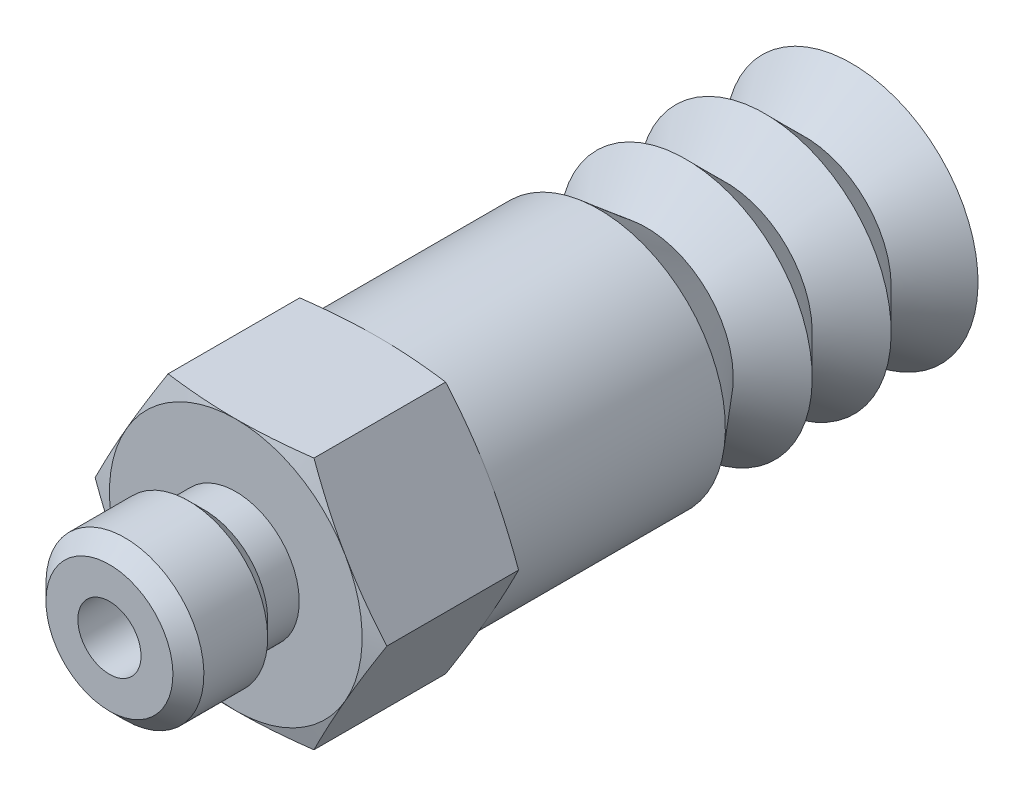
ISO-10303-21;
HEADER;
FILE_DESCRIPTION(('STEP AP214'),'2;1');
FILE_NAME('part.step','',(''),(''),'','','');
FILE_SCHEMA(('AUTOMOTIVE_DESIGN { 1 0 10303 214 1 1 1 1 }'));
ENDSEC;
DATA;
#1=APPLICATION_CONTEXT('core data for automotive mechanical design processes');
#2=APPLICATION_PROTOCOL_DEFINITION('international standard','automotive_design',2000,#1);
#3=PRODUCT_CONTEXT('',#1,'mechanical');
#4=PRODUCT('Part','Part','',(#3));
#5=PRODUCT_RELATED_PRODUCT_CATEGORY('part','',(#4));
#6=PRODUCT_DEFINITION_FORMATION('','',#4);
#7=PRODUCT_DEFINITION_CONTEXT('part definition',#1,'design');
#8=PRODUCT_DEFINITION('design','',#6,#7);
#9=PRODUCT_DEFINITION_SHAPE('','',#8);
#10=(LENGTH_UNIT() NAMED_UNIT(*) SI_UNIT(.MILLI.,.METRE.));
#11=(NAMED_UNIT(*) PLANE_ANGLE_UNIT() SI_UNIT($,.RADIAN.));
#12=(NAMED_UNIT(*) SI_UNIT($,.STERADIAN.) SOLID_ANGLE_UNIT());
#13=UNCERTAINTY_MEASURE_WITH_UNIT(LENGTH_MEASURE(1.E-05),#10,'distance_accuracy_value','');
#14=(GEOMETRIC_REPRESENTATION_CONTEXT(3) GLOBAL_UNCERTAINTY_ASSIGNED_CONTEXT((#13)) GLOBAL_UNIT_ASSIGNED_CONTEXT((#10,
#11,#12)) REPRESENTATION_CONTEXT('',''));
#15=CARTESIAN_POINT('',(0.,0.,0.));
#16=DIRECTION('',(0.,0.,1.));
#17=DIRECTION('',(1.,0.,0.));
#18=AXIS2_PLACEMENT_3D('',#15,#16,#17);
#19=CARTESIAN_POINT('',(4.61880215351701,0.,19.5));
#20=DIRECTION('',(-0.866025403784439,-0.5,0.));
#21=DIRECTION('',(0.,0.,-1.));
#22=AXIS2_PLACEMENT_3D('',#19,#20,#21);
#23=PLANE('',#22);
#24=CARTESIAN_POINT('',(4.61880215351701,0.,15.1658075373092));
#25=CARTESIAN_POINT('',(4.00000000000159,1.07179676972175,15.));
#26=CARTESIAN_POINT('',(3.46410161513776,2.,15.));
#27=B_SPLINE_CURVE_WITH_KNOTS('',2,(#24,#25,#26),.UNSPECIFIED.,.F.,.F.,(3,3),(0.,1.),.UNSPECIFIED.);
#28=CARTESIAN_POINT('',(4.61880215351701,0.,15.1658075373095));
#29=VERTEX_POINT('',#28);
#30=CARTESIAN_POINT('',(3.46410161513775,2.,15.));
#31=VERTEX_POINT('',#30);
#32=EDGE_CURVE('E430',#29,#31,#27,.T.);
#33=ORIENTED_EDGE('',*,*,#32,.T.);
#34=CARTESIAN_POINT('',(3.46410161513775,2.00000000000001,15.));
#35=CARTESIAN_POINT('',(2.92820323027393,2.92820323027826,15.));
#36=CARTESIAN_POINT('',(2.30940107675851,4.,15.1658075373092));
#37=B_SPLINE_CURVE_WITH_KNOTS('',2,(#34,#35,#36),.UNSPECIFIED.,.F.,.F.,(3,3),(0.,1.),.UNSPECIFIED.);
#38=CARTESIAN_POINT('',(2.3094010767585,4.,15.1658075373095));
#39=VERTEX_POINT('',#38);
#40=EDGE_CURVE('E447',#31,#39,#37,.T.);
#41=ORIENTED_EDGE('',*,*,#40,.T.);
#42=DIRECTION('',(0.,0.,-1.));
#43=VECTOR('',#42,1.);
#44=CARTESIAN_POINT('',(2.3094010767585,4.,19.5));
#45=LINE('',#44,#43);
#46=CARTESIAN_POINT('',(2.3094010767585,4.,19.3341924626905));
#47=VERTEX_POINT('',#46);
#48=EDGE_CURVE('E10',#47,#39,#45,.T.);
#49=ORIENTED_EDGE('',*,*,#48,.F.);
#50=CARTESIAN_POINT('',(2.30940107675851,4.,19.3341924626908));
#51=CARTESIAN_POINT('',(2.92820323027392,2.92820323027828,19.5));
#52=CARTESIAN_POINT('',(3.46410161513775,2.00000000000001,19.5));
#53=B_SPLINE_CURVE_WITH_KNOTS('',2,(#50,#51,#52),.UNSPECIFIED.,.F.,.F.,(3,3),(0.,1.),.UNSPECIFIED.);
#54=CARTESIAN_POINT('',(3.46410161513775,2.,19.5));
#55=VERTEX_POINT('',#54);
#56=EDGE_CURVE('E229',#47,#55,#53,.T.);
#57=ORIENTED_EDGE('',*,*,#56,.T.);
#58=CARTESIAN_POINT('',(3.46410161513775,2.00000000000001,19.5));
#59=CARTESIAN_POINT('',(4.0000000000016,1.07179676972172,19.5));
#60=CARTESIAN_POINT('',(4.61880215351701,0.,19.3341924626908));
#61=B_SPLINE_CURVE_WITH_KNOTS('',2,(#58,#59,#60),.UNSPECIFIED.,.F.,.F.,(3,3),(0.,1.),.UNSPECIFIED.);
#62=CARTESIAN_POINT('',(4.61880215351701,0.,19.3341924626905));
#63=VERTEX_POINT('',#62);
#64=EDGE_CURVE('E335',#55,#63,#61,.T.);
#65=ORIENTED_EDGE('',*,*,#64,.T.);
#66=DIRECTION('',(0.,0.,-1.));
#67=VECTOR('',#66,1.);
#68=CARTESIAN_POINT('',(4.61880215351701,0.,19.5));
#69=LINE('',#68,#67);
#70=EDGE_CURVE('E253',#63,#29,#69,.T.);
#71=ORIENTED_EDGE('',*,*,#70,.T.);
#72=EDGE_LOOP('',(#33,#41,#49,#57,#65,#71));
#73=FACE_BOUND('',#72,.T.);
#74=ADVANCED_FACE('F15',(#73),#23,.F.);
#75=CARTESIAN_POINT('',(2.3094010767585,4.,19.5));
#76=DIRECTION('',(0.,-1.,0.));
#77=DIRECTION('',(0.,0.,-1.));
#78=AXIS2_PLACEMENT_3D('',#75,#76,#77);
#79=PLANE('',#78);
#80=CARTESIAN_POINT('',(2.3094010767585,4.,15.1658075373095));
#81=CARTESIAN_POINT('',(1.07179676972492,4.,15.));
#82=CARTESIAN_POINT('',(0.,4.,15.));
#83=B_SPLINE_CURVE_WITH_KNOTS('',2,(#80,#81,#82),.UNSPECIFIED.,.F.,.F.,(3,3),(0.,1.),.UNSPECIFIED.);
#84=CARTESIAN_POINT('',(0.,4.,15.));
#85=VERTEX_POINT('',#84);
#86=EDGE_CURVE('E277',#39,#85,#83,.T.);
#87=ORIENTED_EDGE('',*,*,#86,.T.);
#88=CARTESIAN_POINT('',(0.,4.,15.));
#89=CARTESIAN_POINT('',(-1.0717967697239,4.,15.));
#90=CARTESIAN_POINT('',(-2.3094010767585,4.,15.1658075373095));
#91=B_SPLINE_CURVE_WITH_KNOTS('',2,(#88,#89,#90),.UNSPECIFIED.,.F.,.F.,(3,3),(0.,1.),.UNSPECIFIED.);
#92=CARTESIAN_POINT('',(-2.3094010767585,4.,15.1658075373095));
#93=VERTEX_POINT('',#92);
#94=EDGE_CURVE('E600',#85,#93,#91,.T.);
#95=ORIENTED_EDGE('',*,*,#94,.T.);
#96=DIRECTION('',(0.,0.,-1.));
#97=VECTOR('',#96,1.);
#98=CARTESIAN_POINT('',(-2.3094010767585,4.,19.5));
#99=LINE('',#98,#97);
#100=CARTESIAN_POINT('',(-2.3094010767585,4.,19.3341924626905));
#101=VERTEX_POINT('',#100);
#102=EDGE_CURVE('E29',#101,#93,#99,.T.);
#103=ORIENTED_EDGE('',*,*,#102,.F.);
#104=CARTESIAN_POINT('',(-2.3094010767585,4.,19.3341924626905));
#105=CARTESIAN_POINT('',(-1.07179676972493,4.,19.5));
#106=CARTESIAN_POINT('',(0.,4.,19.5));
#107=B_SPLINE_CURVE_WITH_KNOTS('',2,(#104,#105,#106),.UNSPECIFIED.,.F.,.F.,(3,3),(0.,1.),.UNSPECIFIED.);
#108=CARTESIAN_POINT('',(0.,4.,19.5));
#109=VERTEX_POINT('',#108);
#110=EDGE_CURVE('E280',#101,#109,#107,.T.);
#111=ORIENTED_EDGE('',*,*,#110,.T.);
#112=CARTESIAN_POINT('',(0.,4.,19.5));
#113=CARTESIAN_POINT('',(1.07179676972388,4.,19.5));
#114=CARTESIAN_POINT('',(2.3094010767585,4.,19.3341924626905));
#115=B_SPLINE_CURVE_WITH_KNOTS('',2,(#112,#113,#114),.UNSPECIFIED.,.F.,.F.,(3,3),(0.,1.),.UNSPECIFIED.);
#116=EDGE_CURVE('E1335',#109,#47,#115,.T.);
#117=ORIENTED_EDGE('',*,*,#116,.T.);
#118=ORIENTED_EDGE('',*,*,#48,.T.);
#119=EDGE_LOOP('',(#87,#95,#103,#111,#117,#118));
#120=FACE_BOUND('',#119,.T.);
#121=ADVANCED_FACE('F304',(#120),#79,.F.);
#122=CARTESIAN_POINT('',(-2.3094010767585,4.,19.5));
#123=DIRECTION('',(0.866025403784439,-0.5,0.));
#124=DIRECTION('',(0.5,0.866025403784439,0.));
#125=AXIS2_PLACEMENT_3D('',#122,#123,#124);
#126=PLANE('',#125);
#127=CARTESIAN_POINT('',(-2.3094010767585,4.,15.1658075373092));
#128=CARTESIAN_POINT('',(-2.92820323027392,2.92820323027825,15.));
#129=CARTESIAN_POINT('',(-3.46410161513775,1.99999999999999,15.));
#130=B_SPLINE_CURVE_WITH_KNOTS('',2,(#127,#128,#129),.UNSPECIFIED.,.F.,.F.,(3,3),(0.,1.),.UNSPECIFIED.);
#131=CARTESIAN_POINT('',(-3.46410161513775,2.,15.));
#132=VERTEX_POINT('',#131);
#133=EDGE_CURVE('E575',#93,#132,#130,.T.);
#134=ORIENTED_EDGE('',*,*,#133,.T.);
#135=CARTESIAN_POINT('',(-3.46410161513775,1.99999999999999,15.));
#136=CARTESIAN_POINT('',(-4.00000000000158,1.07179676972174,15.));
#137=CARTESIAN_POINT('',(-4.618802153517,0.,15.1658075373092));
#138=B_SPLINE_CURVE_WITH_KNOTS('',2,(#135,#136,#137),.UNSPECIFIED.,.F.,.F.,(3,3),(0.,1.),.UNSPECIFIED.);
#139=CARTESIAN_POINT('',(-4.61880215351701,0.,15.1658075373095));
#140=VERTEX_POINT('',#139);
#141=EDGE_CURVE('E648',#132,#140,#138,.T.);
#142=ORIENTED_EDGE('',*,*,#141,.T.);
#143=DIRECTION('',(0.,0.,-1.));
#144=VECTOR('',#143,1.);
#145=CARTESIAN_POINT('',(-4.61880215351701,0.,19.5));
#146=LINE('',#145,#144);
#147=CARTESIAN_POINT('',(-4.61880215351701,0.,19.3341924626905));
#148=VERTEX_POINT('',#147);
#149=EDGE_CURVE('E525',#148,#140,#146,.T.);
#150=ORIENTED_EDGE('',*,*,#149,.F.);
#151=CARTESIAN_POINT('',(-4.618802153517,0.,19.3341924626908));
#152=CARTESIAN_POINT('',(-4.0000000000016,1.07179676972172,19.5));
#153=CARTESIAN_POINT('',(-3.46410161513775,2.,19.5));
#154=B_SPLINE_CURVE_WITH_KNOTS('',2,(#151,#152,#153),.UNSPECIFIED.,.F.,.F.,(3,3),(0.,1.),.UNSPECIFIED.);
#155=CARTESIAN_POINT('',(-3.46410161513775,2.,19.5));
#156=VERTEX_POINT('',#155);
#157=EDGE_CURVE('E768',#148,#156,#154,.T.);
#158=ORIENTED_EDGE('',*,*,#157,.T.);
#159=CARTESIAN_POINT('',(-3.46410161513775,1.99999999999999,19.5));
#160=CARTESIAN_POINT('',(-2.92820323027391,2.92820323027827,19.5));
#161=CARTESIAN_POINT('',(-2.3094010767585,4.,19.3341924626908));
#162=B_SPLINE_CURVE_WITH_KNOTS('',2,(#159,#160,#161),.UNSPECIFIED.,.F.,.F.,(3,3),(0.,1.),.UNSPECIFIED.);
#163=EDGE_CURVE('E531',#156,#101,#162,.T.);
#164=ORIENTED_EDGE('',*,*,#163,.T.);
#165=ORIENTED_EDGE('',*,*,#102,.T.);
#166=EDGE_LOOP('',(#134,#142,#150,#158,#164,#165));
#167=FACE_BOUND('',#166,.T.);
#168=ADVANCED_FACE('F483',(#167),#126,.F.);
#169=CARTESIAN_POINT('',(-4.61880215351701,0.,19.5));
#170=DIRECTION('',(0.866025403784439,0.5,0.));
#171=DIRECTION('',(0.,0.,1.));
#172=AXIS2_PLACEMENT_3D('',#169,#170,#171);
#173=PLANE('',#172);
#174=CARTESIAN_POINT('',(-4.61880215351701,0.,15.1658075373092));
#175=CARTESIAN_POINT('',(-4.00000000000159,-1.07179676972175,15.));
#176=CARTESIAN_POINT('',(-3.46410161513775,-2.00000000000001,15.));
#177=B_SPLINE_CURVE_WITH_KNOTS('',2,(#174,#175,#176),.UNSPECIFIED.,.F.,.F.,(3,3),(0.,1.),.UNSPECIFIED.);
#178=CARTESIAN_POINT('',(-3.46410161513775,-2.,15.));
#179=VERTEX_POINT('',#178);
#180=EDGE_CURVE('E636',#140,#179,#177,.T.);
#181=ORIENTED_EDGE('',*,*,#180,.T.);
#182=CARTESIAN_POINT('',(-3.46410161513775,-2.00000000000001,15.));
#183=CARTESIAN_POINT('',(-2.92820323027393,-2.92820323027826,15.));
#184=CARTESIAN_POINT('',(-2.30940107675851,-4.,15.1658075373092));
#185=B_SPLINE_CURVE_WITH_KNOTS('',2,(#182,#183,#184),.UNSPECIFIED.,.F.,.F.,(3,3),(0.,1.),.UNSPECIFIED.);
#186=CARTESIAN_POINT('',(-2.3094010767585,-4.,15.1658075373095));
#187=VERTEX_POINT('',#186);
#188=EDGE_CURVE('E664',#179,#187,#185,.T.);
#189=ORIENTED_EDGE('',*,*,#188,.T.);
#190=DIRECTION('',(0.,0.,-1.));
#191=VECTOR('',#190,1.);
#192=CARTESIAN_POINT('',(-2.3094010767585,-4.,19.5));
#193=LINE('',#192,#191);
#194=CARTESIAN_POINT('',(-2.3094010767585,-4.,19.3341924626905));
#195=VERTEX_POINT('',#194);
#196=EDGE_CURVE('E750',#195,#187,#193,.T.);
#197=ORIENTED_EDGE('',*,*,#196,.F.);
#198=CARTESIAN_POINT('',(-2.30940107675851,-4.,19.3341924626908));
#199=CARTESIAN_POINT('',(-2.92820323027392,-2.92820323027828,19.5));
#200=CARTESIAN_POINT('',(-3.46410161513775,-2.00000000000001,19.5));
#201=B_SPLINE_CURVE_WITH_KNOTS('',2,(#198,#199,#200),.UNSPECIFIED.,.F.,.F.,(3,3),(0.,1.),.UNSPECIFIED.);
#202=CARTESIAN_POINT('',(-3.46410161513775,-2.,19.5));
#203=VERTEX_POINT('',#202);
#204=EDGE_CURVE('E753',#195,#203,#201,.T.);
#205=ORIENTED_EDGE('',*,*,#204,.T.);
#206=CARTESIAN_POINT('',(-3.46410161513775,-2.00000000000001,19.5));
#207=CARTESIAN_POINT('',(-4.0000000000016,-1.07179676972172,19.5));
#208=CARTESIAN_POINT('',(-4.61880215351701,0.,19.3341924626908));
#209=B_SPLINE_CURVE_WITH_KNOTS('',2,(#206,#207,#208),.UNSPECIFIED.,.F.,.F.,(3,3),(0.,1.),.UNSPECIFIED.);
#210=EDGE_CURVE('E1382',#203,#148,#209,.T.);
#211=ORIENTED_EDGE('',*,*,#210,.T.);
#212=ORIENTED_EDGE('',*,*,#149,.T.);
#213=EDGE_LOOP('',(#181,#189,#197,#205,#211,#212));
#214=FACE_BOUND('',#213,.T.);
#215=ADVANCED_FACE('F484',(#214),#173,.F.);
#216=CARTESIAN_POINT('',(-2.3094010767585,-4.,19.5));
#217=DIRECTION('',(0.,1.,0.));
#218=DIRECTION('',(-1.,0.,0.));
#219=AXIS2_PLACEMENT_3D('',#216,#217,#218);
#220=PLANE('',#219);
#221=CARTESIAN_POINT('',(-2.3094010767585,-4.,15.1658075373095));
#222=CARTESIAN_POINT('',(-1.07179676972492,-4.,15.));
#223=CARTESIAN_POINT('',(0.,-4.,15.));
#224=B_SPLINE_CURVE_WITH_KNOTS('',2,(#221,#222,#223),.UNSPECIFIED.,.F.,.F.,(3,3),(0.,1.),.UNSPECIFIED.);
#225=CARTESIAN_POINT('',(0.,-4.,15.));
#226=VERTEX_POINT('',#225);
#227=EDGE_CURVE('E652',#187,#226,#224,.T.);
#228=ORIENTED_EDGE('',*,*,#227,.T.);
#229=CARTESIAN_POINT('',(0.,-4.,15.));
#230=CARTESIAN_POINT('',(1.0717967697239,-4.,15.));
#231=CARTESIAN_POINT('',(2.3094010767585,-4.,15.1658075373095));
#232=B_SPLINE_CURVE_WITH_KNOTS('',2,(#229,#230,#231),.UNSPECIFIED.,.F.,.F.,(3,3),(0.,1.),.UNSPECIFIED.);
#233=CARTESIAN_POINT('',(2.3094010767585,-4.,15.1658075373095));
#234=VERTEX_POINT('',#233);
#235=EDGE_CURVE('E630',#226,#234,#232,.T.);
#236=ORIENTED_EDGE('',*,*,#235,.T.);
#237=DIRECTION('',(0.,0.,-1.));
#238=VECTOR('',#237,1.);
#239=CARTESIAN_POINT('',(2.3094010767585,-4.,19.5));
#240=LINE('',#239,#238);
#241=CARTESIAN_POINT('',(2.3094010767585,-4.,19.3341924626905));
#242=VERTEX_POINT('',#241);
#243=EDGE_CURVE('E346',#242,#234,#240,.T.);
#244=ORIENTED_EDGE('',*,*,#243,.F.);
#245=CARTESIAN_POINT('',(2.3094010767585,-4.,19.3341924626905));
#246=CARTESIAN_POINT('',(1.07179676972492,-4.,19.5));
#247=CARTESIAN_POINT('',(0.,-4.,19.5));
#248=B_SPLINE_CURVE_WITH_KNOTS('',2,(#245,#246,#247),.UNSPECIFIED.,.F.,.F.,(3,3),(0.,1.),.UNSPECIFIED.);
#249=CARTESIAN_POINT('',(0.,-4.,19.5));
#250=VERTEX_POINT('',#249);
#251=EDGE_CURVE('E773',#242,#250,#248,.T.);
#252=ORIENTED_EDGE('',*,*,#251,.T.);
#253=CARTESIAN_POINT('',(0.,-4.,19.5));
#254=CARTESIAN_POINT('',(-1.07179676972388,-4.,19.5));
#255=CARTESIAN_POINT('',(-2.3094010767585,-4.,19.3341924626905));
#256=B_SPLINE_CURVE_WITH_KNOTS('',2,(#253,#254,#255),.UNSPECIFIED.,.F.,.F.,(3,3),(0.,1.),.UNSPECIFIED.);
#257=EDGE_CURVE('E763',#250,#195,#256,.T.);
#258=ORIENTED_EDGE('',*,*,#257,.T.);
#259=ORIENTED_EDGE('',*,*,#196,.T.);
#260=EDGE_LOOP('',(#228,#236,#244,#252,#258,#259));
#261=FACE_BOUND('',#260,.T.);
#262=ADVANCED_FACE('F368',(#261),#220,.F.);
#263=CARTESIAN_POINT('',(2.3094010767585,-4.,19.5));
#264=DIRECTION('',(-0.866025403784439,0.5,0.));
#265=DIRECTION('',(0.,0.,-1.));
#266=AXIS2_PLACEMENT_3D('',#263,#264,#265);
#267=PLANE('',#266);
#268=CARTESIAN_POINT('',(2.3094010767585,-4.,15.1658075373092));
#269=CARTESIAN_POINT('',(2.92820323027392,-2.92820323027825,15.));
#270=CARTESIAN_POINT('',(3.46410161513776,-2.,15.));
#271=B_SPLINE_CURVE_WITH_KNOTS('',2,(#268,#269,#270),.UNSPECIFIED.,.F.,.F.,(3,3),(0.,1.),.UNSPECIFIED.);
#272=CARTESIAN_POINT('',(3.46410161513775,-2.,15.));
#273=VERTEX_POINT('',#272);
#274=EDGE_CURVE('E617',#234,#273,#271,.T.);
#275=ORIENTED_EDGE('',*,*,#274,.T.);
#276=CARTESIAN_POINT('',(3.46410161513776,-2.,15.));
#277=CARTESIAN_POINT('',(4.00000000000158,-1.07179676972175,15.));
#278=CARTESIAN_POINT('',(4.61880215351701,0.,15.1658075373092));
#279=B_SPLINE_CURVE_WITH_KNOTS('',2,(#276,#277,#278),.UNSPECIFIED.,.F.,.F.,(3,3),(0.,1.),.UNSPECIFIED.);
#280=EDGE_CURVE('E397',#273,#29,#279,.T.);
#281=ORIENTED_EDGE('',*,*,#280,.T.);
#282=ORIENTED_EDGE('',*,*,#70,.F.);
#283=CARTESIAN_POINT('',(4.61880215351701,0.,19.3341924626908));
#284=CARTESIAN_POINT('',(4.0000000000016,-1.07179676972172,19.5));
#285=CARTESIAN_POINT('',(3.46410161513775,-2.,19.5));
#286=B_SPLINE_CURVE_WITH_KNOTS('',2,(#283,#284,#285),.UNSPECIFIED.,.F.,.F.,(3,3),(0.,1.),.UNSPECIFIED.);
#287=CARTESIAN_POINT('',(3.46410161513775,-2.,19.5));
#288=VERTEX_POINT('',#287);
#289=EDGE_CURVE('E353',#63,#288,#286,.T.);
#290=ORIENTED_EDGE('',*,*,#289,.T.);
#291=CARTESIAN_POINT('',(3.46410161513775,-2.,19.5));
#292=CARTESIAN_POINT('',(2.92820323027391,-2.92820323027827,19.5));
#293=CARTESIAN_POINT('',(2.3094010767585,-4.,19.3341924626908));
#294=B_SPLINE_CURVE_WITH_KNOTS('',2,(#291,#292,#293),.UNSPECIFIED.,.F.,.F.,(3,3),(0.,1.),.UNSPECIFIED.);
#295=EDGE_CURVE('E1321',#288,#242,#294,.T.);
#296=ORIENTED_EDGE('',*,*,#295,.T.);
#297=ORIENTED_EDGE('',*,*,#243,.T.);
#298=EDGE_LOOP('',(#275,#281,#282,#290,#296,#297));
#299=FACE_BOUND('',#298,.T.);
#300=ADVANCED_FACE('F358',(#299),#267,.F.);
#301=CARTESIAN_POINT('',(-2.0095,0.,23.5));
#302=DIRECTION('',(0.,0.,1.));
#303=DIRECTION('',(-1.,0.,0.));
#304=AXIS2_PLACEMENT_3D('',#301,#302,#303);
#305=PLANE('',#304);
#306=CARTESIAN_POINT('',(0.,0.,23.5));
#307=DIRECTION('',(0.,0.,-1.));
#308=DIRECTION('',(0.,-1.,0.));
#309=AXIS2_PLACEMENT_3D('',#306,#307,#308);
#310=CIRCLE('',#309,2.0095);
#311=CARTESIAN_POINT('',(0.,-2.0095,23.5));
#312=VERTEX_POINT('',#311);
#313=EDGE_CURVE('E41',#312,#312,#310,.T.);
#314=ORIENTED_EDGE('',*,*,#313,.F.);
#315=EDGE_LOOP('',(#314));
#316=FACE_BOUND('',#315,.T.);
#317=CARTESIAN_POINT('',(0.,0.,23.5));
#318=DIRECTION('',(0.,0.,-1.));
#319=DIRECTION('',(0.,-1.,0.));
#320=AXIS2_PLACEMENT_3D('',#317,#318,#319);
#321=CIRCLE('',#320,1.);
#322=CARTESIAN_POINT('',(0.,-1.,23.5));
#323=VERTEX_POINT('',#322);
#324=EDGE_CURVE('E261',#323,#323,#321,.T.);
#325=ORIENTED_EDGE('',*,*,#324,.T.);
#326=EDGE_LOOP('',(#325));
#327=FACE_BOUND('',#326,.T.);
#328=ADVANCED_FACE('F367',(#316,#327),#305,.T.);
#329=CARTESIAN_POINT('',(0.,0.,23.0095));
#330=DIRECTION('',(0.,0.,-1.));
#331=DIRECTION('',(0.,-1.,0.));
#332=AXIS2_PLACEMENT_3D('',#329,#330,#331);
#333=CONICAL_SURFACE('',#332,2.5,0.785398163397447);
#334=CARTESIAN_POINT('',(0.,0.,23.0095));
#335=DIRECTION('',(0.,0.,-1.));
#336=DIRECTION('',(0.,-1.,0.));
#337=AXIS2_PLACEMENT_3D('',#334,#335,#336);
#338=CIRCLE('',#337,2.5);
#339=CARTESIAN_POINT('',(0.,-2.5,23.0095));
#340=VERTEX_POINT('',#339);
#341=EDGE_CURVE('E226',#340,#340,#338,.T.);
#342=ORIENTED_EDGE('',*,*,#341,.F.);
#343=EDGE_LOOP('',(#342));
#344=FACE_BOUND('',#343,.T.);
#345=ORIENTED_EDGE('',*,*,#313,.T.);
#346=EDGE_LOOP('',(#345));
#347=FACE_BOUND('',#346,.T.);
#348=ADVANCED_FACE('F815',(#344,#347),#333,.T.);
#349=CARTESIAN_POINT('',(0.,0.,15.));
#350=DIRECTION('',(0.,0.,-1.));
#351=DIRECTION('',(0.,-1.,0.));
#352=AXIS2_PLACEMENT_3D('',#349,#350,#351);
#353=CYLINDRICAL_SURFACE('',#352,2.5);
#354=CARTESIAN_POINT('',(0.,0.,20.9905));
#355=DIRECTION('',(0.,0.,-1.));
#356=DIRECTION('',(0.,-1.,0.));
#357=AXIS2_PLACEMENT_3D('',#354,#355,#356);
#358=CIRCLE('',#357,2.5);
#359=CARTESIAN_POINT('',(0.,-2.5,20.9905));
#360=VERTEX_POINT('',#359);
#361=EDGE_CURVE('E218',#360,#360,#358,.T.);
#362=ORIENTED_EDGE('',*,*,#361,.F.);
#363=EDGE_LOOP('',(#362));
#364=FACE_BOUND('',#363,.T.);
#365=ORIENTED_EDGE('',*,*,#341,.T.);
#366=EDGE_LOOP('',(#365));
#367=FACE_BOUND('',#366,.T.);
#368=ADVANCED_FACE('F814',(#364,#367),#353,.T.);
#369=CARTESIAN_POINT('',(0.,0.,20.5));
#370=DIRECTION('',(0.,0.,1.));
#371=DIRECTION('',(0.,1.,0.));
#372=AXIS2_PLACEMENT_3D('',#369,#370,#371);
#373=CONICAL_SURFACE('',#372,2.0095,0.785398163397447);
#374=CARTESIAN_POINT('',(0.,0.,20.5));
#375=DIRECTION('',(0.,0.,-1.));
#376=DIRECTION('',(0.,-1.,0.));
#377=AXIS2_PLACEMENT_3D('',#374,#375,#376);
#378=CIRCLE('',#377,2.0095);
#379=CARTESIAN_POINT('',(0.,-2.0095,20.5));
#380=VERTEX_POINT('',#379);
#381=EDGE_CURVE('E214',#380,#380,#378,.T.);
#382=ORIENTED_EDGE('',*,*,#381,.F.);
#383=EDGE_LOOP('',(#382));
#384=FACE_BOUND('',#383,.T.);
#385=ORIENTED_EDGE('',*,*,#361,.T.);
#386=EDGE_LOOP('',(#385));
#387=FACE_BOUND('',#386,.T.);
#388=ADVANCED_FACE('F803',(#384,#387),#373,.T.);
#389=CARTESIAN_POINT('',(0.,0.,15.));
#390=DIRECTION('',(0.,0.,-1.));
#391=DIRECTION('',(0.,-1.,0.));
#392=AXIS2_PLACEMENT_3D('',#389,#390,#391);
#393=CYLINDRICAL_SURFACE('',#392,2.0095);
#394=CARTESIAN_POINT('',(0.,0.,19.5));
#395=DIRECTION('',(0.,0.,-1.));
#396=DIRECTION('',(0.,-1.,0.));
#397=AXIS2_PLACEMENT_3D('',#394,#395,#396);
#398=CIRCLE('',#397,2.0095);
#399=CARTESIAN_POINT('',(0.,-2.0095,19.5));
#400=VERTEX_POINT('',#399);
#401=EDGE_CURVE('E219',#400,#400,#398,.T.);
#402=ORIENTED_EDGE('',*,*,#401,.F.);
#403=EDGE_LOOP('',(#402));
#404=FACE_BOUND('',#403,.T.);
#405=ORIENTED_EDGE('',*,*,#381,.T.);
#406=EDGE_LOOP('',(#405));
#407=FACE_BOUND('',#406,.T.);
#408=ADVANCED_FACE('F215',(#404,#407),#393,.T.);
#409=CARTESIAN_POINT('',(-4.,0.,19.5));
#410=DIRECTION('',(0.,0.,1.));
#411=DIRECTION('',(-1.,0.,0.));
#412=AXIS2_PLACEMENT_3D('',#409,#410,#411);
#413=PLANE('',#412);
#414=CARTESIAN_POINT('',(0.,0.,19.5));
#415=DIRECTION('',(0.,0.,-1.));
#416=DIRECTION('',(0.,-1.,0.));
#417=AXIS2_PLACEMENT_3D('',#414,#415,#416);
#418=CIRCLE('',#417,4.);
#419=EDGE_CURVE('E1378',#203,#156,#418,.T.);
#420=ORIENTED_EDGE('',*,*,#419,.F.);
#421=CARTESIAN_POINT('',(0.,0.,19.5));
#422=DIRECTION('',(0.,0.,-1.));
#423=DIRECTION('',(0.,-1.,0.));
#424=AXIS2_PLACEMENT_3D('',#421,#422,#423);
#425=CIRCLE('',#424,4.);
#426=EDGE_CURVE('E766',#250,#203,#425,.T.);
#427=ORIENTED_EDGE('',*,*,#426,.F.);
#428=CARTESIAN_POINT('',(0.,0.,19.5));
#429=DIRECTION('',(0.,0.,-1.));
#430=DIRECTION('',(0.,-1.,0.));
#431=AXIS2_PLACEMENT_3D('',#428,#429,#430);
#432=CIRCLE('',#431,4.);
#433=EDGE_CURVE('E791',#288,#250,#432,.T.);
#434=ORIENTED_EDGE('',*,*,#433,.F.);
#435=CARTESIAN_POINT('',(0.,0.,19.5));
#436=DIRECTION('',(0.,0.,-1.));
#437=DIRECTION('',(0.,-1.,0.));
#438=AXIS2_PLACEMENT_3D('',#435,#436,#437);
#439=CIRCLE('',#438,4.);
#440=EDGE_CURVE('E1323',#55,#288,#439,.T.);
#441=ORIENTED_EDGE('',*,*,#440,.F.);
#442=CARTESIAN_POINT('',(0.,0.,19.5));
#443=DIRECTION('',(0.,0.,-1.));
#444=DIRECTION('',(0.,-1.,0.));
#445=AXIS2_PLACEMENT_3D('',#442,#443,#444);
#446=CIRCLE('',#445,4.);
#447=EDGE_CURVE('E1336',#109,#55,#446,.T.);
#448=ORIENTED_EDGE('',*,*,#447,.F.);
#449=CARTESIAN_POINT('',(0.,0.,19.5));
#450=DIRECTION('',(0.,0.,-1.));
#451=DIRECTION('',(0.,-1.,0.));
#452=AXIS2_PLACEMENT_3D('',#449,#450,#451);
#453=CIRCLE('',#452,4.);
#454=EDGE_CURVE('E1366',#156,#109,#453,.T.);
#455=ORIENTED_EDGE('',*,*,#454,.F.);
#456=EDGE_LOOP('',(#420,#427,#434,#441,#448,#455));
#457=FACE_BOUND('',#456,.T.);
#458=ORIENTED_EDGE('',*,*,#401,.T.);
#459=EDGE_LOOP('',(#458));
#460=FACE_BOUND('',#459,.T.);
#461=ADVANCED_FACE('F851',(#457,#460),#413,.T.);
#462=CARTESIAN_POINT('',(0.,0.,19.2856406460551));
#463=DIRECTION('',(0.,0.,-1.));
#464=DIRECTION('',(0.,-1.,0.));
#465=AXIS2_PLACEMENT_3D('',#462,#463,#464);
#466=CONICAL_SURFACE('',#465,4.8,1.30899693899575);
#467=ORIENTED_EDGE('',*,*,#116,.F.);
#468=ORIENTED_EDGE('',*,*,#447,.T.);
#469=ORIENTED_EDGE('',*,*,#56,.F.);
#470=EDGE_LOOP('',(#467,#468,#469));
#471=FACE_BOUND('',#470,.T.);
#472=ADVANCED_FACE('F859',(#471),#466,.T.);
#473=CARTESIAN_POINT('',(0.,0.,15.));
#474=DIRECTION('',(0.,0.,1.));
#475=DIRECTION('',(0.,1.,0.));
#476=AXIS2_PLACEMENT_3D('',#473,#474,#475);
#477=CONICAL_SURFACE('',#476,4.,1.30899693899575);
#478=ORIENTED_EDGE('',*,*,#86,.F.);
#479=ORIENTED_EDGE('',*,*,#40,.F.);
#480=CARTESIAN_POINT('',(0.,0.,15.));
#481=DIRECTION('',(0.,0.,-1.));
#482=DIRECTION('',(0.,-1.,0.));
#483=AXIS2_PLACEMENT_3D('',#480,#481,#482);
#484=CIRCLE('',#483,4.);
#485=EDGE_CURVE('E237',#85,#31,#484,.T.);
#486=ORIENTED_EDGE('',*,*,#485,.F.);
#487=EDGE_LOOP('',(#478,#479,#486));
#488=FACE_BOUND('',#487,.T.);
#489=ADVANCED_FACE('F867',(#488),#477,.T.);
#490=CARTESIAN_POINT('',(-1.,0.,15.));
#491=DIRECTION('',(0.,0.,-1.));
#492=DIRECTION('',(0.,-1.,0.));
#493=AXIS2_PLACEMENT_3D('',#490,#491,#492);
#494=PLANE('',#493);
#495=CARTESIAN_POINT('',(0.,0.,15.));
#496=DIRECTION('',(0.,0.,-1.));
#497=DIRECTION('',(0.,-1.,0.));
#498=AXIS2_PLACEMENT_3D('',#495,#496,#497);
#499=CIRCLE('',#498,1.);
#500=CARTESIAN_POINT('',(0.,-1.,15.));
#501=VERTEX_POINT('',#500);
#502=EDGE_CURVE('E258',#501,#501,#499,.T.);
#503=ORIENTED_EDGE('',*,*,#502,.F.);
#504=EDGE_LOOP('',(#503));
#505=FACE_BOUND('',#504,.T.);
#506=CARTESIAN_POINT('',(0.,0.,15.));
#507=DIRECTION('',(0.,0.,-1.));
#508=DIRECTION('',(0.,-1.,0.));
#509=AXIS2_PLACEMENT_3D('',#506,#507,#508);
#510=CIRCLE('',#509,2.);
#511=CARTESIAN_POINT('',(0.,-2.,15.));
#512=VERTEX_POINT('',#511);
#513=EDGE_CURVE('E239',#512,#512,#510,.T.);
#514=ORIENTED_EDGE('',*,*,#513,.T.);
#515=EDGE_LOOP('',(#514));
#516=FACE_BOUND('',#515,.T.);
#517=ADVANCED_FACE('F305',(#505,#516),#494,.T.);
#518=CARTESIAN_POINT('',(0.,0.,15.));
#519=DIRECTION('',(0.,0.,-1.));
#520=DIRECTION('',(0.,-1.,0.));
#521=AXIS2_PLACEMENT_3D('',#518,#519,#520);
#522=CYLINDRICAL_SURFACE('',#521,1.);
#523=ORIENTED_EDGE('',*,*,#324,.F.);
#524=EDGE_LOOP('',(#523));
#525=FACE_BOUND('',#524,.T.);
#526=ORIENTED_EDGE('',*,*,#502,.T.);
#527=EDGE_LOOP('',(#526));
#528=FACE_BOUND('',#527,.T.);
#529=ADVANCED_FACE('F702',(#525,#528),#522,.F.);
#530=CARTESIAN_POINT('',(0.,0.,0.));
#531=DIRECTION('',(0.,0.,-1.));
#532=DIRECTION('',(0.,-1.,0.));
#533=AXIS2_PLACEMENT_3D('',#530,#531,#532);
#534=CYLINDRICAL_SURFACE('',#533,4.);
#535=CARTESIAN_POINT('',(0.,0.,8.));
#536=DIRECTION('',(0.,0.,-1.));
#537=DIRECTION('',(0.,-1.,0.));
#538=AXIS2_PLACEMENT_3D('',#535,#536,#537);
#539=CIRCLE('',#538,4.);
#540=CARTESIAN_POINT('',(0.,-4.,8.));
#541=VERTEX_POINT('',#540);
#542=EDGE_CURVE('E235',#541,#541,#539,.T.);
#543=ORIENTED_EDGE('',*,*,#542,.F.);
#544=EDGE_LOOP('',(#543));
#545=FACE_BOUND('',#544,.T.);
#546=CARTESIAN_POINT('',(0.,0.,15.));
#547=DIRECTION('',(0.,0.,-1.));
#548=DIRECTION('',(0.,-1.,0.));
#549=AXIS2_PLACEMENT_3D('',#546,#547,#548);
#550=CIRCLE('',#549,4.);
#551=EDGE_CURVE('E657',#226,#179,#550,.T.);
#552=ORIENTED_EDGE('',*,*,#551,.T.);
#553=CARTESIAN_POINT('',(0.,0.,15.));
#554=DIRECTION('',(0.,0.,-1.));
#555=DIRECTION('',(0.,-1.,0.));
#556=AXIS2_PLACEMENT_3D('',#553,#554,#555);
#557=CIRCLE('',#556,4.);
#558=EDGE_CURVE('E579',#179,#132,#557,.T.);
#559=ORIENTED_EDGE('',*,*,#558,.T.);
#560=CARTESIAN_POINT('',(0.,0.,15.));
#561=DIRECTION('',(0.,0.,-1.));
#562=DIRECTION('',(0.,-1.,0.));
#563=AXIS2_PLACEMENT_3D('',#560,#561,#562);
#564=CIRCLE('',#563,4.);
#565=EDGE_CURVE('E458',#132,#85,#564,.T.);
#566=ORIENTED_EDGE('',*,*,#565,.T.);
#567=ORIENTED_EDGE('',*,*,#485,.T.);
#568=CARTESIAN_POINT('',(0.,0.,15.));
#569=DIRECTION('',(0.,0.,-1.));
#570=DIRECTION('',(0.,-1.,0.));
#571=AXIS2_PLACEMENT_3D('',#568,#569,#570);
#572=CIRCLE('',#571,4.);
#573=EDGE_CURVE('E450',#31,#273,#572,.T.);
#574=ORIENTED_EDGE('',*,*,#573,.T.);
#575=CARTESIAN_POINT('',(0.,0.,15.));
#576=DIRECTION('',(0.,0.,-1.));
#577=DIRECTION('',(0.,-1.,0.));
#578=AXIS2_PLACEMENT_3D('',#575,#576,#577);
#579=CIRCLE('',#578,4.);
#580=EDGE_CURVE('E403',#273,#226,#579,.T.);
#581=ORIENTED_EDGE('',*,*,#580,.T.);
#582=EDGE_LOOP('',(#552,#559,#566,#567,#574,#581));
#583=FACE_BOUND('',#582,.T.);
#584=ADVANCED_FACE('F826',(#545,#583),#534,.T.);
#585=CARTESIAN_POINT('',(0.,0.,6.5));
#586=DIRECTION('',(0.,0.,1.));
#587=DIRECTION('',(0.,1.,0.));
#588=AXIS2_PLACEMENT_3D('',#585,#586,#587);
#589=CONICAL_SURFACE('',#588,2.75,0.694738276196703);
#590=CARTESIAN_POINT('',(0.,0.,6.5));
#591=DIRECTION('',(0.,0.,-1.));
#592=DIRECTION('',(0.,-1.,0.));
#593=AXIS2_PLACEMENT_3D('',#590,#591,#592);
#594=CIRCLE('',#593,2.75);
#595=CARTESIAN_POINT('',(0.,-2.75,6.5));
#596=VERTEX_POINT('',#595);
#597=EDGE_CURVE('E238',#596,#596,#594,.T.);
#598=ORIENTED_EDGE('',*,*,#597,.F.);
#599=EDGE_LOOP('',(#598));
#600=FACE_BOUND('',#599,.T.);
#601=ORIENTED_EDGE('',*,*,#542,.T.);
#602=EDGE_LOOP('',(#601));
#603=FACE_BOUND('',#602,.T.);
#604=ADVANCED_FACE('F824',(#600,#603),#589,.T.);
#605=CARTESIAN_POINT('',(0.,0.,5.25));
#606=DIRECTION('',(0.,0.,-1.));
#607=DIRECTION('',(0.,-1.,0.));
#608=AXIS2_PLACEMENT_3D('',#605,#606,#607);
#609=CONICAL_SURFACE('',#608,4.,0.785398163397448);
#610=CARTESIAN_POINT('',(0.,0.,5.25));
#611=DIRECTION('',(0.,0.,-1.));
#612=DIRECTION('',(0.,-1.,0.));
#613=AXIS2_PLACEMENT_3D('',#610,#611,#612);
#614=CIRCLE('',#613,4.);
#615=CARTESIAN_POINT('',(0.,-4.,5.25));
#616=VERTEX_POINT('',#615);
#617=EDGE_CURVE('E233',#616,#616,#614,.T.);
#618=ORIENTED_EDGE('',*,*,#617,.F.);
#619=EDGE_LOOP('',(#618));
#620=FACE_BOUND('',#619,.T.);
#621=ORIENTED_EDGE('',*,*,#597,.T.);
#622=EDGE_LOOP('',(#621));
#623=FACE_BOUND('',#622,.T.);
#624=ADVANCED_FACE('F416',(#620,#623),#609,.T.);
#625=CARTESIAN_POINT('',(0.,0.,4.));
#626=DIRECTION('',(0.,0.,1.));
#627=DIRECTION('',(0.,1.,0.));
#628=AXIS2_PLACEMENT_3D('',#625,#626,#627);
#629=CONICAL_SURFACE('',#628,2.75,0.785398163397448);
#630=CARTESIAN_POINT('',(0.,0.,4.));
#631=DIRECTION('',(0.,0.,-1.));
#632=DIRECTION('',(0.,-1.,0.));
#633=AXIS2_PLACEMENT_3D('',#630,#631,#632);
#634=CIRCLE('',#633,2.75);
#635=CARTESIAN_POINT('',(0.,-2.75,4.));
#636=VERTEX_POINT('',#635);
#637=EDGE_CURVE('E257',#636,#636,#634,.T.);
#638=ORIENTED_EDGE('',*,*,#637,.F.);
#639=EDGE_LOOP('',(#638));
#640=FACE_BOUND('',#639,.T.);
#641=ORIENTED_EDGE('',*,*,#617,.T.);
#642=EDGE_LOOP('',(#641));
#643=FACE_BOUND('',#642,.T.);
#644=ADVANCED_FACE('F905',(#640,#643),#629,.T.);
#645=CARTESIAN_POINT('',(0.,0.,2.75));
#646=DIRECTION('',(0.,0.,-1.));
#647=DIRECTION('',(0.,-1.,0.));
#648=AXIS2_PLACEMENT_3D('',#645,#646,#647);
#649=CONICAL_SURFACE('',#648,4.,0.785398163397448);
#650=CARTESIAN_POINT('',(0.,0.,2.75));
#651=DIRECTION('',(0.,0.,-1.));
#652=DIRECTION('',(0.,-1.,0.));
#653=AXIS2_PLACEMENT_3D('',#650,#651,#652);
#654=CIRCLE('',#653,4.);
#655=CARTESIAN_POINT('',(0.,-4.,2.75));
#656=VERTEX_POINT('',#655);
#657=EDGE_CURVE('E251',#656,#656,#654,.T.);
#658=ORIENTED_EDGE('',*,*,#657,.F.);
#659=EDGE_LOOP('',(#658));
#660=FACE_BOUND('',#659,.T.);
#661=ORIENTED_EDGE('',*,*,#637,.T.);
#662=EDGE_LOOP('',(#661));
#663=FACE_BOUND('',#662,.T.);
#664=ADVANCED_FACE('F912',(#660,#663),#649,.T.);
#665=CARTESIAN_POINT('',(0.,0.,1.5));
#666=DIRECTION('',(0.,0.,1.));
#667=DIRECTION('',(0.,1.,0.));
#668=AXIS2_PLACEMENT_3D('',#665,#666,#667);
#669=CONICAL_SURFACE('',#668,2.75,0.785398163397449);
#670=CARTESIAN_POINT('',(0.,0.,1.5));
#671=DIRECTION('',(0.,0.,-1.));
#672=DIRECTION('',(0.,-1.,0.));
#673=AXIS2_PLACEMENT_3D('',#670,#671,#672);
#674=CIRCLE('',#673,2.75);
#675=CARTESIAN_POINT('',(0.,-2.75,1.5));
#676=VERTEX_POINT('',#675);
#677=EDGE_CURVE('E246',#676,#676,#674,.T.);
#678=ORIENTED_EDGE('',*,*,#677,.F.);
#679=EDGE_LOOP('',(#678));
#680=FACE_BOUND('',#679,.T.);
#681=ORIENTED_EDGE('',*,*,#657,.T.);
#682=EDGE_LOOP('',(#681));
#683=FACE_BOUND('',#682,.T.);
#684=ADVANCED_FACE('F704',(#680,#683),#669,.T.);
#685=CARTESIAN_POINT('',(0.,0.,0.));
#686=DIRECTION('',(0.,0.,-1.));
#687=DIRECTION('',(0.,-1.,0.));
#688=AXIS2_PLACEMENT_3D('',#685,#686,#687);
#689=CONICAL_SURFACE('',#688,4.,0.694738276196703);
#690=CARTESIAN_POINT('',(0.,0.,0.));
#691=DIRECTION('',(0.,0.,-1.));
#692=DIRECTION('',(0.,-1.,0.));
#693=AXIS2_PLACEMENT_3D('',#690,#691,#692);
#694=CIRCLE('',#693,4.);
#695=CARTESIAN_POINT('',(0.,-4.,0.));
#696=VERTEX_POINT('',#695);
#697=EDGE_CURVE('E244',#696,#696,#694,.T.);
#698=ORIENTED_EDGE('',*,*,#697,.F.);
#699=EDGE_LOOP('',(#698));
#700=FACE_BOUND('',#699,.T.);
#701=ORIENTED_EDGE('',*,*,#677,.T.);
#702=EDGE_LOOP('',(#701));
#703=FACE_BOUND('',#702,.T.);
#704=ADVANCED_FACE('F819',(#700,#703),#689,.T.);
#705=CARTESIAN_POINT('',(-3.7,0.,0.));
#706=DIRECTION('',(0.,0.,-1.));
#707=DIRECTION('',(0.,-1.,0.));
#708=AXIS2_PLACEMENT_3D('',#705,#706,#707);
#709=PLANE('',#708);
#710=CARTESIAN_POINT('',(0.,0.,0.));
#711=DIRECTION('',(0.,0.,-1.));
#712=DIRECTION('',(0.,-1.,0.));
#713=AXIS2_PLACEMENT_3D('',#710,#711,#712);
#714=CIRCLE('',#713,3.7);
#715=CARTESIAN_POINT('',(0.,-3.7,0.));
#716=VERTEX_POINT('',#715);
#717=EDGE_CURVE('E247',#716,#716,#714,.T.);
#718=ORIENTED_EDGE('',*,*,#717,.F.);
#719=EDGE_LOOP('',(#718));
#720=FACE_BOUND('',#719,.T.);
#721=ORIENTED_EDGE('',*,*,#697,.T.);
#722=EDGE_LOOP('',(#721));
#723=FACE_BOUND('',#722,.T.);
#724=ADVANCED_FACE('F822',(#720,#723),#709,.T.);
#725=CARTESIAN_POINT('',(0.,0.,1.5));
#726=DIRECTION('',(0.,0.,-1.));
#727=DIRECTION('',(0.,-1.,0.));
#728=AXIS2_PLACEMENT_3D('',#725,#726,#727);
#729=CONICAL_SURFACE('',#728,2.5,0.674740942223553);
#730=CARTESIAN_POINT('',(0.,0.,1.5));
#731=DIRECTION('',(0.,0.,-1.));
#732=DIRECTION('',(0.,-1.,0.));
#733=AXIS2_PLACEMENT_3D('',#730,#731,#732);
#734=CIRCLE('',#733,2.5);
#735=CARTESIAN_POINT('',(0.,-2.5,1.5));
#736=VERTEX_POINT('',#735);
#737=EDGE_CURVE('E270',#736,#736,#734,.T.);
#738=ORIENTED_EDGE('',*,*,#737,.F.);
#739=EDGE_LOOP('',(#738));
#740=FACE_BOUND('',#739,.T.);
#741=ORIENTED_EDGE('',*,*,#717,.T.);
#742=EDGE_LOOP('',(#741));
#743=FACE_BOUND('',#742,.T.);
#744=ADVANCED_FACE('F487',(#740,#743),#729,.F.);
#745=CARTESIAN_POINT('',(0.,0.,2.75));
#746=DIRECTION('',(0.,0.,1.));
#747=DIRECTION('',(0.,1.,0.));
#748=AXIS2_PLACEMENT_3D('',#745,#746,#747);
#749=CONICAL_SURFACE('',#748,3.25,0.540419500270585);
#750=CARTESIAN_POINT('',(0.,0.,2.75));
#751=DIRECTION('',(0.,0.,-1.));
#752=DIRECTION('',(0.,-1.,0.));
#753=AXIS2_PLACEMENT_3D('',#750,#751,#752);
#754=CIRCLE('',#753,3.25);
#755=CARTESIAN_POINT('',(0.,-3.25,2.75));
#756=VERTEX_POINT('',#755);
#757=EDGE_CURVE('E265',#756,#756,#754,.T.);
#758=ORIENTED_EDGE('',*,*,#757,.F.);
#759=EDGE_LOOP('',(#758));
#760=FACE_BOUND('',#759,.T.);
#761=ORIENTED_EDGE('',*,*,#737,.T.);
#762=EDGE_LOOP('',(#761));
#763=FACE_BOUND('',#762,.T.);
#764=ADVANCED_FACE('F418',(#760,#763),#749,.F.);
#765=CARTESIAN_POINT('',(0.,0.,4.));
#766=DIRECTION('',(0.,0.,-1.));
#767=DIRECTION('',(0.,-1.,0.));
#768=AXIS2_PLACEMENT_3D('',#765,#766,#767);
#769=CONICAL_SURFACE('',#768,2.,0.785398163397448);
#770=CARTESIAN_POINT('',(0.,0.,4.));
#771=DIRECTION('',(0.,0.,-1.));
#772=DIRECTION('',(0.,-1.,0.));
#773=AXIS2_PLACEMENT_3D('',#770,#771,#772);
#774=CIRCLE('',#773,2.);
#775=CARTESIAN_POINT('',(0.,-2.,4.));
#776=VERTEX_POINT('',#775);
#777=EDGE_CURVE('E262',#776,#776,#774,.T.);
#778=ORIENTED_EDGE('',*,*,#777,.F.);
#779=EDGE_LOOP('',(#778));
#780=FACE_BOUND('',#779,.T.);
#781=ORIENTED_EDGE('',*,*,#757,.T.);
#782=EDGE_LOOP('',(#781));
#783=FACE_BOUND('',#782,.T.);
#784=ADVANCED_FACE('F369',(#780,#783),#769,.F.);
#785=CARTESIAN_POINT('',(0.,0.,5.25));
#786=DIRECTION('',(0.,0.,1.));
#787=DIRECTION('',(0.,1.,0.));
#788=AXIS2_PLACEMENT_3D('',#785,#786,#787);
#789=CONICAL_SURFACE('',#788,3.25,0.785398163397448);
#790=CARTESIAN_POINT('',(0.,0.,5.25));
#791=DIRECTION('',(0.,0.,-1.));
#792=DIRECTION('',(0.,-1.,0.));
#793=AXIS2_PLACEMENT_3D('',#790,#791,#792);
#794=CIRCLE('',#793,3.25);
#795=CARTESIAN_POINT('',(0.,-3.25,5.25));
#796=VERTEX_POINT('',#795);
#797=EDGE_CURVE('E242',#796,#796,#794,.T.);
#798=ORIENTED_EDGE('',*,*,#797,.F.);
#799=EDGE_LOOP('',(#798));
#800=FACE_BOUND('',#799,.T.);
#801=ORIENTED_EDGE('',*,*,#777,.T.);
#802=EDGE_LOOP('',(#801));
#803=FACE_BOUND('',#802,.T.);
#804=ADVANCED_FACE('F953',(#800,#803),#789,.F.);
#805=CARTESIAN_POINT('',(0.,0.,6.5));
#806=DIRECTION('',(0.,0.,-1.));
#807=DIRECTION('',(0.,-1.,0.));
#808=AXIS2_PLACEMENT_3D('',#805,#806,#807);
#809=CONICAL_SURFACE('',#808,2.,0.785398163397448);
#810=CARTESIAN_POINT('',(0.,0.,6.5));
#811=DIRECTION('',(0.,0.,-1.));
#812=DIRECTION('',(0.,-1.,0.));
#813=AXIS2_PLACEMENT_3D('',#810,#811,#812);
#814=CIRCLE('',#813,2.);
#815=CARTESIAN_POINT('',(0.,-2.,6.5));
#816=VERTEX_POINT('',#815);
#817=EDGE_CURVE('E243',#816,#816,#814,.T.);
#818=ORIENTED_EDGE('',*,*,#817,.F.);
#819=EDGE_LOOP('',(#818));
#820=FACE_BOUND('',#819,.T.);
#821=ORIENTED_EDGE('',*,*,#797,.T.);
#822=EDGE_LOOP('',(#821));
#823=FACE_BOUND('',#822,.T.);
#824=ADVANCED_FACE('F960',(#820,#823),#809,.F.);
#825=CARTESIAN_POINT('',(0.,0.,0.));
#826=DIRECTION('',(0.,0.,-1.));
#827=DIRECTION('',(0.,-1.,0.));
#828=AXIS2_PLACEMENT_3D('',#825,#826,#827);
#829=CYLINDRICAL_SURFACE('',#828,2.);
#830=ORIENTED_EDGE('',*,*,#513,.F.);
#831=EDGE_LOOP('',(#830));
#832=FACE_BOUND('',#831,.T.);
#833=ORIENTED_EDGE('',*,*,#817,.T.);
#834=EDGE_LOOP('',(#833));
#835=FACE_BOUND('',#834,.T.);
#836=ADVANCED_FACE('F548',(#832,#835),#829,.F.);
#837=CARTESIAN_POINT('',(0.,0.,19.2856406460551));
#838=DIRECTION('',(0.,0.,-1.));
#839=DIRECTION('',(0.,-1.,0.));
#840=AXIS2_PLACEMENT_3D('',#837,#838,#839);
#841=CONICAL_SURFACE('',#840,4.8,1.30899693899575);
#842=ORIENTED_EDGE('',*,*,#163,.F.);
#843=ORIENTED_EDGE('',*,*,#454,.T.);
#844=ORIENTED_EDGE('',*,*,#110,.F.);
#845=EDGE_LOOP('',(#842,#843,#844));
#846=FACE_BOUND('',#845,.T.);
#847=ADVANCED_FACE('F17',(#846),#841,.T.);
#848=CARTESIAN_POINT('',(0.,0.,19.2856406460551));
#849=DIRECTION('',(0.,0.,-1.));
#850=DIRECTION('',(0.,-1.,0.));
#851=AXIS2_PLACEMENT_3D('',#848,#849,#850);
#852=CONICAL_SURFACE('',#851,4.8,1.30899693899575);
#853=ORIENTED_EDGE('',*,*,#157,.F.);
#854=ORIENTED_EDGE('',*,*,#210,.F.);
#855=ORIENTED_EDGE('',*,*,#419,.T.);
#856=EDGE_LOOP('',(#853,#854,#855));
#857=FACE_BOUND('',#856,.T.);
#858=ADVANCED_FACE('F802',(#857),#852,.T.);
#859=CARTESIAN_POINT('',(0.,0.,19.2856406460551));
#860=DIRECTION('',(0.,0.,-1.));
#861=DIRECTION('',(0.,-1.,0.));
#862=AXIS2_PLACEMENT_3D('',#859,#860,#861);
#863=CONICAL_SURFACE('',#862,4.8,1.30899693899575);
#864=ORIENTED_EDGE('',*,*,#257,.F.);
#865=ORIENTED_EDGE('',*,*,#426,.T.);
#866=ORIENTED_EDGE('',*,*,#204,.F.);
#867=EDGE_LOOP('',(#864,#865,#866));
#868=FACE_BOUND('',#867,.T.);
#869=ADVANCED_FACE('F762',(#868),#863,.T.);
#870=CARTESIAN_POINT('',(0.,0.,19.2856406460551));
#871=DIRECTION('',(0.,0.,-1.));
#872=DIRECTION('',(0.,-1.,0.));
#873=AXIS2_PLACEMENT_3D('',#870,#871,#872);
#874=CONICAL_SURFACE('',#873,4.8,1.30899693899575);
#875=ORIENTED_EDGE('',*,*,#295,.F.);
#876=ORIENTED_EDGE('',*,*,#433,.T.);
#877=ORIENTED_EDGE('',*,*,#251,.F.);
#878=EDGE_LOOP('',(#875,#876,#877));
#879=FACE_BOUND('',#878,.T.);
#880=ADVANCED_FACE('F801',(#879),#874,.T.);
#881=CARTESIAN_POINT('',(0.,0.,19.2856406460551));
#882=DIRECTION('',(0.,0.,-1.));
#883=DIRECTION('',(0.,-1.,0.));
#884=AXIS2_PLACEMENT_3D('',#881,#882,#883);
#885=CONICAL_SURFACE('',#884,4.8,1.30899693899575);
#886=ORIENTED_EDGE('',*,*,#289,.F.);
#887=ORIENTED_EDGE('',*,*,#64,.F.);
#888=ORIENTED_EDGE('',*,*,#440,.T.);
#889=EDGE_LOOP('',(#886,#887,#888));
#890=FACE_BOUND('',#889,.T.);
#891=ADVANCED_FACE('F307',(#890),#885,.T.);
#892=CARTESIAN_POINT('',(0.,0.,15.));
#893=DIRECTION('',(0.,0.,1.));
#894=DIRECTION('',(0.,1.,0.));
#895=AXIS2_PLACEMENT_3D('',#892,#893,#894);
#896=CONICAL_SURFACE('',#895,4.,1.30899693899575);
#897=ORIENTED_EDGE('',*,*,#280,.F.);
#898=ORIENTED_EDGE('',*,*,#573,.F.);
#899=ORIENTED_EDGE('',*,*,#32,.F.);
#900=EDGE_LOOP('',(#897,#898,#899));
#901=FACE_BOUND('',#900,.T.);
#902=ADVANCED_FACE('F405',(#901),#896,.T.);
#903=CARTESIAN_POINT('',(0.,0.,15.));
#904=DIRECTION('',(0.,0.,1.));
#905=DIRECTION('',(0.,1.,0.));
#906=AXIS2_PLACEMENT_3D('',#903,#904,#905);
#907=CONICAL_SURFACE('',#906,4.,1.30899693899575);
#908=ORIENTED_EDGE('',*,*,#133,.F.);
#909=ORIENTED_EDGE('',*,*,#94,.F.);
#910=ORIENTED_EDGE('',*,*,#565,.F.);
#911=EDGE_LOOP('',(#908,#909,#910));
#912=FACE_BOUND('',#911,.T.);
#913=ADVANCED_FACE('F415',(#912),#907,.T.);
#914=CARTESIAN_POINT('',(0.,0.,15.));
#915=DIRECTION('',(0.,0.,1.));
#916=DIRECTION('',(0.,1.,0.));
#917=AXIS2_PLACEMENT_3D('',#914,#915,#916);
#918=CONICAL_SURFACE('',#917,4.,1.30899693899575);
#919=ORIENTED_EDGE('',*,*,#235,.F.);
#920=ORIENTED_EDGE('',*,*,#580,.F.);
#921=ORIENTED_EDGE('',*,*,#274,.F.);
#922=EDGE_LOOP('',(#919,#920,#921));
#923=FACE_BOUND('',#922,.T.);
#924=ADVANCED_FACE('F589',(#923),#918,.T.);
#925=CARTESIAN_POINT('',(0.,0.,15.));
#926=DIRECTION('',(0.,0.,1.));
#927=DIRECTION('',(0.,1.,0.));
#928=AXIS2_PLACEMENT_3D('',#925,#926,#927);
#929=CONICAL_SURFACE('',#928,4.,1.30899693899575);
#930=ORIENTED_EDGE('',*,*,#141,.F.);
#931=ORIENTED_EDGE('',*,*,#558,.F.);
#932=ORIENTED_EDGE('',*,*,#180,.F.);
#933=EDGE_LOOP('',(#930,#931,#932));
#934=FACE_BOUND('',#933,.T.);
#935=ADVANCED_FACE('F691',(#934),#929,.T.);
#936=CARTESIAN_POINT('',(0.,0.,15.));
#937=DIRECTION('',(0.,0.,1.));
#938=DIRECTION('',(0.,1.,0.));
#939=AXIS2_PLACEMENT_3D('',#936,#937,#938);
#940=CONICAL_SURFACE('',#939,4.,1.30899693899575);
#941=ORIENTED_EDGE('',*,*,#188,.F.);
#942=ORIENTED_EDGE('',*,*,#551,.F.);
#943=ORIENTED_EDGE('',*,*,#227,.F.);
#944=EDGE_LOOP('',(#941,#942,#943));
#945=FACE_BOUND('',#944,.T.);
#946=ADVANCED_FACE('F701',(#945),#940,.T.);
#947=CLOSED_SHELL('',(#74,#121,#168,#215,#262,#300,#328,#348,#368,#388,#408,#461,#472,#489,#517,
#529,#584,#604,#624,#644,#664,#684,#704,#724,#744,#764,#784,#804,#824,#836,#847,#858,#869,#880,
#891,#902,#913,#924,#935,#946));
#948=MANIFOLD_SOLID_BREP('B1',#947);
#949=ADVANCED_BREP_SHAPE_REPRESENTATION('',(#18,#948),#14);
#950=SHAPE_DEFINITION_REPRESENTATION(#9,#949);
ENDSEC;
END-ISO-10303-21;
